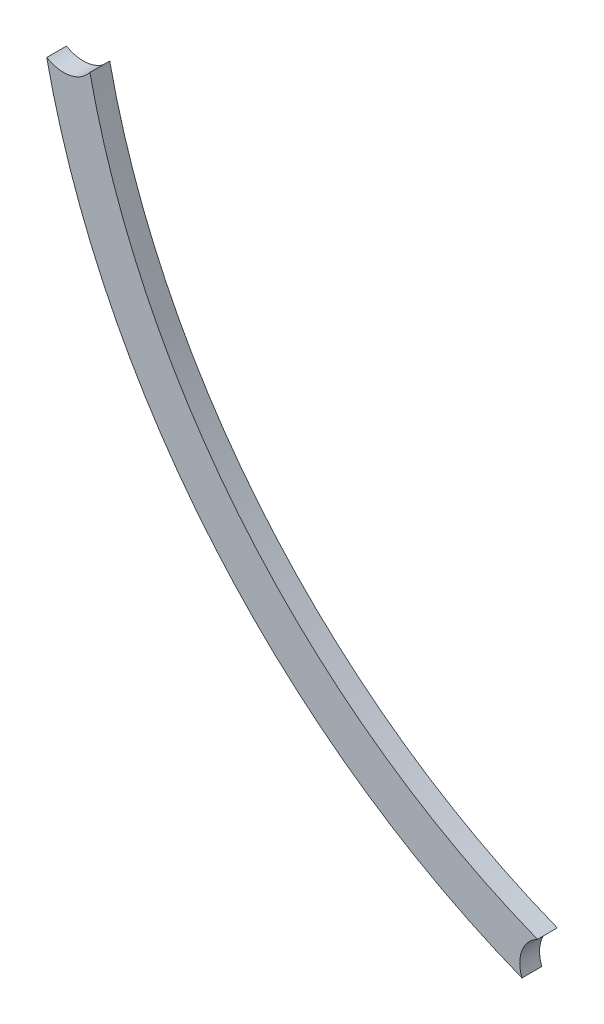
from build123d import *

# Parameters (mm, degrees)
SKETCH1_R          = 448.564
BASE_EXTRUDE_DEPTH = 11.43
SKETCH2_R          = 423.164
CUT_EXTRUDE1_DEPTH = 635.468256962
CUT_EXTRUDE2_DEPTH = 635.468256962


with BuildPart() as part:
    # Sketch1 → Base-Extrude (new body)
    with BuildSketch(Plane.XY):
        Circle(SKETCH1_R)
    extrude(amount=BASE_EXTRUDE_DEPTH)

    # Sketch2 → Cut-Extrude1 (cut, through all)
    with BuildSketch(Plane.XY.offset(11.43)):
        Circle(SKETCH2_R)
    extrude(amount=-CUT_EXTRUDE1_DEPTH, mode=Mode.SUBTRACT)

    # Sketch3 → Cut-Extrude2 (cut, through all)
    with BuildSketch(Plane.XY.offset(11.43)):
        with BuildLine():
            Line((-409.733504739, -78.244057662), (0, 0))
            Line((0, 0), (-141.265731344, -392.180412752))
            ThreePointArc((-141.265731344, -392.180412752), (-164.553139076, -404.003562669), (-154.154038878, -427.96079431))
            Line((-154.154038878, -427.96079431), (-156.615569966, -434.794470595))
            ThreePointArc((-156.615569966, -434.794470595), (351.410087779, 300.142663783), (-453.938622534, -86.685612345))
            Line((-453.938622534, -86.685612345), (-446.492997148, -85.263771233))
            ThreePointArc((-446.492997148, -85.263771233), (-425.210224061, -96.955929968), (-409.733504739, -78.244057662))
        make_face()
    extrude(amount=-CUT_EXTRUDE2_DEPTH, mode=Mode.SUBTRACT)


solid = part.part
